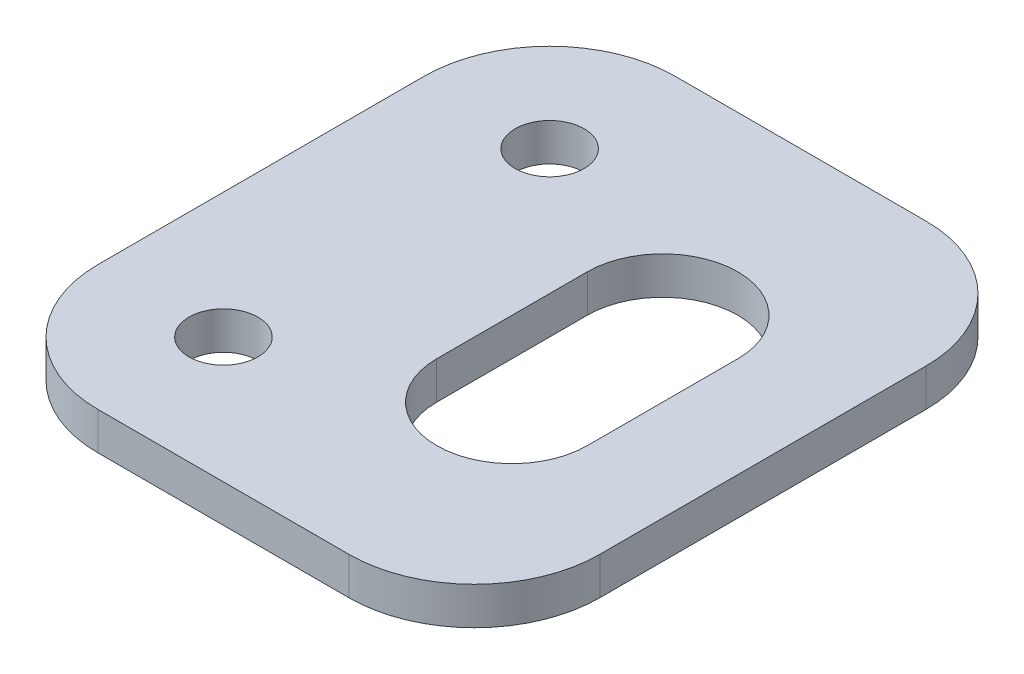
from build123d import *

# Parameters (mm, degrees)
SKETCH1_R      = 2.75
EXTRUDE1_DEPTH = 3


with BuildPart() as part:
    # Sketch1 → Extrude1 (new body)
    with BuildSketch(Plane(origin=(0, 0, 0), x_dir=(1, 0, 0), z_dir=(0, 1, 0))):
        with BuildLine():
            Line((10, 0), (30, 0))
            ThreePointArc((30, 0), (37.071067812, 2.928932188), (40, 10))
            Line((40, 10), (40, 36))
            ThreePointArc((40, 36), (37.071067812, 43.071067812), (30, 46))
            Line((30, 46), (10, 46))
            ThreePointArc((10, 46), (2.928932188, 43.071067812), (0, 36))
            Line((0, 36), (0, 10))
            ThreePointArc((0, 10), (2.928932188, 2.928932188), (10, 0))
        make_face()
        with Locations(Location((10, 36, 0), (0, 0, 270))):
            Circle(SKETCH1_R, mode=Mode.SUBTRACT)
        with Locations(Location((10, 10, 0), (0, 0, 270))):
            Circle(SKETCH1_R, mode=Mode.SUBTRACT)
        with BuildLine():
            Line((32, 29), (32, 17))
            ThreePointArc((32, 17), (26, 11), (20, 17))
            Line((20, 17), (20, 29))
            ThreePointArc((20, 29), (26, 35), (32, 29))
        make_face(mode=Mode.SUBTRACT)
    extrude(amount=EXTRUDE1_DEPTH)


solid = part.part
